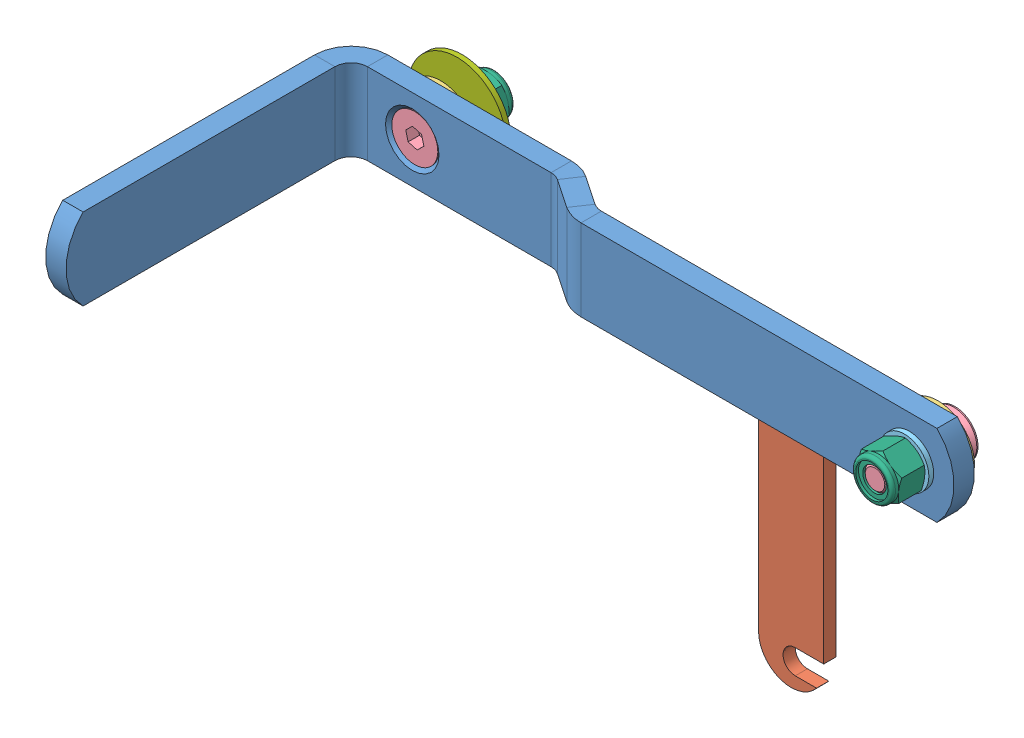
SolidWorks assembly Frein gauche assemblé.sldasm, configuration Défaut (file format 7000). Lengths in mm.
Overall size (160.58 81.84 90.27).
11 component instances, 7 part files, 16 mates.
Components (placement in the parent):
- Patin de frein gauche-1: Patin de frein gauche.SLDASM [Défaut] at origin size (160 75 75)
  - Patin de frein-1: Patin de frein.SLDPRT [Défaut] at origin size (160 20 75)
  - Attache ressort de frein-1: Attache ressort de frein.SLDPRT [Défaut] at (113 -10 -65) x (1 0 0) z (0 0 -1) size (16 55 3)
- Rondelle plate Nylon Type L-6-1: Rondelle plate Nylon Type L-6.SLDPRT [Défaut] at (144 0 -68) x (0 0 -1) z (0.936739 -0.350029 0) size (2 18 18)
- Vis à tête fraisée à six pans creux FHC M6 - 20-1: Vis à tête fraisée à six pans creux FHC M6 - 20.SLDPRT [Réaliste] at (144 0 -71.28) x (-0.136971 -0.990575 0) z (0 0 1) size (11.3 11.3 19.65)
- Rondelle plate Type Z-6-1: Rondelle plate Type Z-6.SLDPRT [Défaut] at (144 0 -63) x (0 0 1) z (0.672432 0.740159 0) size (1.2 12 12)
- Ecrou hexagonal autofreiné - M6-1: Ecrou hexagonal autofreiné - M6.SLDPRT [Mise en plan] at (144 0 -61.8) x (0.992621 -0.121262 0) z (0 0 -1) size (10 11.55 8)
- Vis à tête fraisée à six pans creux FHC M6 - 20-3: Vis à tête fraisée à six pans creux FHC M6 - 20.SLDPRT [Réaliste] at (15 0 -73.57) x (-0.703602 0.710594 0) z (0 0 -1) size (11.3 11.3 19.65)
- Rondelle plate Nylon Type L-6-3: Rondelle plate Nylon Type L-6.SLDPRT [Défaut] at (15 0 -75) x (0 0 -1) z (-0.721761 -0.692142 0) size (2 18 18)
- Rondelle plate Type LL-6-1: Rondelle plate Type LL-6.SLDPRT [Défaut] at (15 0 -81) x (0 0 -1) z (-0.790155 0.612908 0) size (1.2 24 24)
- Ecrou hexagonal autofreiné - M6-3: Ecrou hexagonal autofreiné - M6.SLDPRT [Mise en plan] at (15 0 -82.2) x (-0.751109 0.660178 0) z (0 0 1) size (10 11.55 8)
Mates (geometry in assembly coordinates):
- Coïncidente1: coincident anti-aligned: plane of Patin de frein gauche-1/Patin de frein-1 through (-1.9055 0 -68) normal (0 0 -1); plane of Rondelle plate Nylon Type L-6-1 through (135.5693 3.1503 -68) normal (0 0 1)
- Coaxiale1: concentric aligned: cylinder of Patin de frein gauche-1/Patin de frein-1 through (144 0 -75) axis (0 0 1) radius 3.05; cylinder of Rondelle plate Nylon Type L-6-1 through (144 0 -68) axis (0 0 1) radius 3.2
- Coaxiale3: concentric aligned: cylinder of Rondelle plate Nylon Type L-6-1 through (144 0 -68) axis (0 0 1) radius 3.2; cylinder of Vis à tête fraisée à six pans creux FHC M6 - 20-1 through (144 0 -71.28) axis (0 0 1) radius 3
- Coïncidente4: coincident anti-aligned: plane of Patin de frein gauche-1/Patin de frein-1 through (-1.9055 0 -63) normal (0 0 1); plane of Rondelle plate Type Z-6-1 through (139.9654 -4.441 -63) normal (0 0 -1)
- Coaxiale4: concentric anti-aligned: cylinder of Vis à tête fraisée à six pans creux FHC M6 - 20-1 through (144 0 -71.28) axis (0 0 1) radius 3; cylinder of Rondelle plate Type Z-6-1 through (144 0 -63) axis (0 0 -1) radius 3.2
- Coïncidente5: coincident anti-aligned: plane of Rondelle plate Type Z-6-1 through (139.9654 -4.441 -61.8) normal (0 0 1); plane of Ecrou hexagonal autofreiné - M6-1 through (137.9867 -7.99 -61.8) normal (0 0 -1)
- Coaxiale5: concentric anti-aligned: cylinder of Vis à tête fraisée à six pans creux FHC M6 - 20-1 through (144 0 -71.28) axis (0 0 1) radius 3; cylinder of Ecrou hexagonal autofreiné - M6-1 through (144 0 -46.9147) axis (0 0 -1) radius 2.4
- Coaxiale9: concentric aligned: cylinder of Patin de frein gauche-1/Patin de frein-1 through (15 0 0) axis (0 0 -1) radius 3.15; cylinder of Vis à tête fraisée à six pans creux FHC M6 - 20-3 through (15 0 -73.57) axis (0 0 -1) radius 3
- Coïncidente8: coincident aligned: cone of Patin de frein gauche-1/Patin de frein-1 through (15 0 -73.42) axis (0 0 -1); cone of Vis à tête fraisée à six pans creux FHC M6 - 20-3 through (15 0 -73.57) axis (0 0 -1)
- Coaxiale10: concentric anti-aligned: cylinder of Vis à tête fraisée à six pans creux FHC M6 - 20-3 through (15 0 -73.57) axis (0 0 -1) radius 3; cylinder of Rondelle plate Nylon Type L-6-3 through (15 0 -75) axis (0 0 1) radius 3.2
- Coïncidente9: coincident anti-aligned: plane of Patin de frein gauche-1/Patin de frein-1 through (0 0 -75) normal (0 0 -1); plane of Rondelle plate Nylon Type L-6-3 through (21.4959 6.2293 -75) normal (0 0 1)
- Coaxiale11: concentric anti-aligned: cylinder of Vis à tête fraisée à six pans creux FHC M6 - 20-3 through (15 0 -73.57) axis (0 0 -1) radius 3; cylinder of Rondelle plate Type LL-6-1 through (15 0 -81) axis (0 0 1) radius 3.2
- Distance2: distance = 4 mm anti-aligned: plane of Rondelle plate Nylon Type L-6-3 through (21.4959 6.2293 -77) normal (0 0 -1); plane of Rondelle plate Type LL-6-1 through (24.4819 -7.3549 -81) normal (0 0 1)
- Coaxiale12: concentric anti-aligned: cylinder of Vis à tête fraisée à six pans creux FHC M6 - 20-3 through (15 0 -73.57) axis (0 0 -1) radius 3; cylinder of Ecrou hexagonal autofreiné - M6-3 through (15 0 -97.0853) axis (0 0 1) radius 2.4
- Coïncidente10: coincident anti-aligned: plane of Rondelle plate Type LL-6-1 through (24.4819 -7.3549 -82.2) normal (0 0 -1); plane of Ecrou hexagonal autofreiné - M6-3 through (13.0382 -9.8057 -82.2) normal (0 0 1)
- Distance3: distance = 4.23 mm aligned: plane of Vis à tête fraisée à six pans creux FHC M6 - 20-1 through (143.2261 -5.5967 -74.23) normal (0 0 -1); plane of Rondelle plate Nylon Type L-6-1 through (135.5693 3.1503 -70) normal (0 0 -1)
